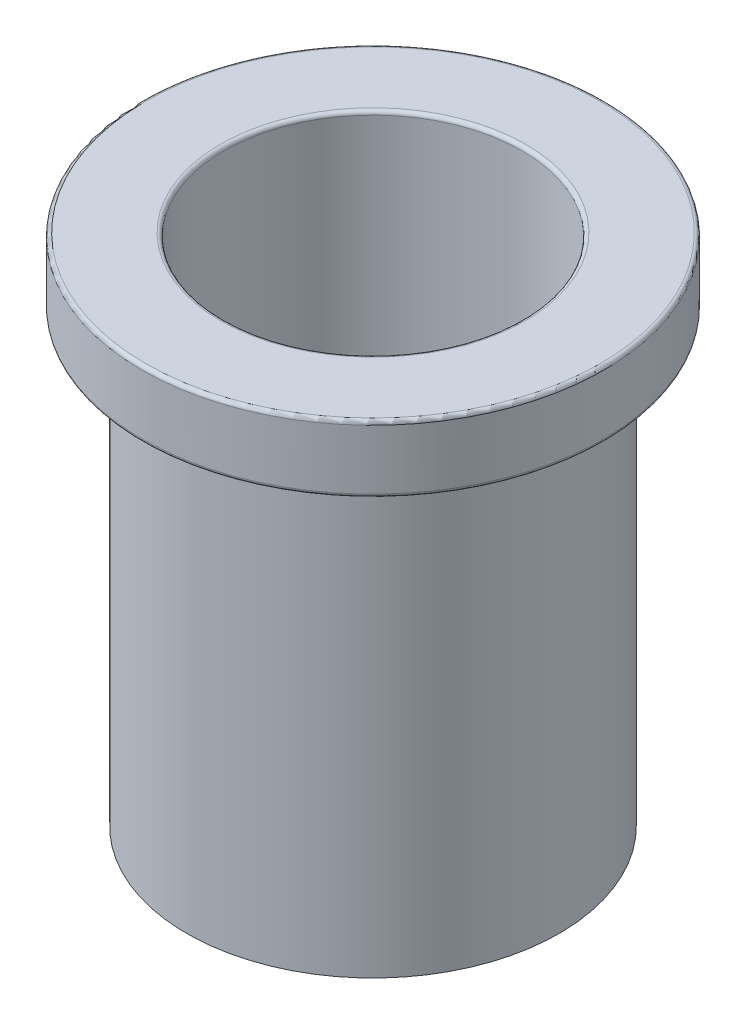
ISO-10303-21;
HEADER;
FILE_DESCRIPTION(('STEP AP214'),'2;1');
FILE_NAME('part.step','',(''),(''),'','','');
FILE_SCHEMA(('AUTOMOTIVE_DESIGN { 1 0 10303 214 1 1 1 1 }'));
ENDSEC;
DATA;
#1=APPLICATION_CONTEXT('core data for automotive mechanical design processes');
#2=APPLICATION_PROTOCOL_DEFINITION('international standard','automotive_design',2000,#1);
#3=PRODUCT_CONTEXT('',#1,'mechanical');
#4=PRODUCT('Part','Part','',(#3));
#5=PRODUCT_RELATED_PRODUCT_CATEGORY('part','',(#4));
#6=PRODUCT_DEFINITION_FORMATION('','',#4);
#7=PRODUCT_DEFINITION_CONTEXT('part definition',#1,'design');
#8=PRODUCT_DEFINITION('design','',#6,#7);
#9=PRODUCT_DEFINITION_SHAPE('','',#8);
#10=(LENGTH_UNIT() NAMED_UNIT(*) SI_UNIT(.MILLI.,.METRE.));
#11=(NAMED_UNIT(*) PLANE_ANGLE_UNIT() SI_UNIT($,.RADIAN.));
#12=(NAMED_UNIT(*) SI_UNIT($,.STERADIAN.) SOLID_ANGLE_UNIT());
#13=UNCERTAINTY_MEASURE_WITH_UNIT(LENGTH_MEASURE(1.E-05),#10,'distance_accuracy_value','');
#14=(GEOMETRIC_REPRESENTATION_CONTEXT(3) GLOBAL_UNCERTAINTY_ASSIGNED_CONTEXT((#13)) GLOBAL_UNIT_ASSIGNED_CONTEXT((#10,
#11,#12)) REPRESENTATION_CONTEXT('',''));
#15=CARTESIAN_POINT('',(0.,0.,0.));
#16=DIRECTION('',(0.,0.,1.));
#17=DIRECTION('',(1.,0.,0.));
#18=AXIS2_PLACEMENT_3D('',#15,#16,#17);
#19=CARTESIAN_POINT('',(3.175,0.,0.));
#20=DIRECTION('',(0.,-1.,0.));
#21=DIRECTION('',(0.,0.,-1.));
#22=AXIS2_PLACEMENT_3D('',#19,#20,#21);
#23=PLANE('',#22);
#24=CARTESIAN_POINT('',(0.,0.,0.));
#25=DIRECTION('',(0.,-1.,0.));
#26=DIRECTION('',(0.,0.,-1.));
#27=AXIS2_PLACEMENT_3D('',#24,#25,#26);
#28=CIRCLE('',#27,3.175);
#29=CARTESIAN_POINT('',(0.,0.,-3.175));
#30=VERTEX_POINT('',#29);
#31=EDGE_CURVE('E49',#30,#30,#28,.T.);
#32=ORIENTED_EDGE('',*,*,#31,.T.);
#33=EDGE_LOOP('',(#32));
#34=FACE_BOUND('',#33,.T.);
#35=CARTESIAN_POINT('',(0.,0.,0.));
#36=DIRECTION('',(0.,-1.,0.));
#37=DIRECTION('',(0.,0.,-1.));
#38=AXIS2_PLACEMENT_3D('',#35,#36,#37);
#39=CIRCLE('',#38,2.54);
#40=CARTESIAN_POINT('',(0.,0.,-2.54));
#41=VERTEX_POINT('',#40);
#42=EDGE_CURVE('E55',#41,#41,#39,.T.);
#43=ORIENTED_EDGE('',*,*,#42,.F.);
#44=EDGE_LOOP('',(#43));
#45=FACE_BOUND('',#44,.T.);
#46=ADVANCED_FACE('F24',(#34,#45),#23,.T.);
#47=CARTESIAN_POINT('',(0.,0.,0.));
#48=DIRECTION('',(0.,-1.,0.));
#49=DIRECTION('',(0.,0.,-1.));
#50=AXIS2_PLACEMENT_3D('',#47,#48,#49);
#51=CYLINDRICAL_SURFACE('',#50,3.175);
#52=CARTESIAN_POINT('',(0.,7.62,0.));
#53=DIRECTION('',(0.,-1.,0.));
#54=DIRECTION('',(0.,0.,-1.));
#55=AXIS2_PLACEMENT_3D('',#52,#53,#54);
#56=CIRCLE('',#55,3.175);
#57=CARTESIAN_POINT('',(0.,7.62,-3.175));
#58=VERTEX_POINT('',#57);
#59=EDGE_CURVE('E52',#58,#58,#56,.T.);
#60=ORIENTED_EDGE('',*,*,#59,.T.);
#61=EDGE_LOOP('',(#60));
#62=FACE_BOUND('',#61,.T.);
#63=ORIENTED_EDGE('',*,*,#31,.F.);
#64=EDGE_LOOP('',(#63));
#65=FACE_BOUND('',#64,.T.);
#66=ADVANCED_FACE('F62',(#62,#65),#51,.T.);
#67=CARTESIAN_POINT('',(3.937,7.62,0.));
#68=DIRECTION('',(0.,-1.,0.));
#69=DIRECTION('',(0.,0.,-1.));
#70=AXIS2_PLACEMENT_3D('',#67,#68,#69);
#71=PLANE('',#70);
#72=CARTESIAN_POINT('',(0.,7.62,0.));
#73=DIRECTION('',(0.,-1.,0.));
#74=DIRECTION('',(0.,0.,-1.));
#75=AXIS2_PLACEMENT_3D('',#72,#73,#74);
#76=CIRCLE('',#75,3.8735);
#77=CARTESIAN_POINT('',(0.,7.62,-3.8735));
#78=VERTEX_POINT('',#77);
#79=EDGE_CURVE('E34',#78,#78,#76,.T.);
#80=ORIENTED_EDGE('',*,*,#79,.T.);
#81=EDGE_LOOP('',(#80));
#82=FACE_BOUND('',#81,.T.);
#83=ORIENTED_EDGE('',*,*,#59,.F.);
#84=EDGE_LOOP('',(#83));
#85=FACE_BOUND('',#84,.T.);
#86=ADVANCED_FACE('F67',(#82,#85),#71,.T.);
#87=CARTESIAN_POINT('',(0.,0.,0.));
#88=DIRECTION('',(0.,-1.,0.));
#89=DIRECTION('',(0.,0.,-1.));
#90=AXIS2_PLACEMENT_3D('',#87,#88,#89);
#91=CYLINDRICAL_SURFACE('',#90,3.937);
#92=CARTESIAN_POINT('',(0.,7.6835,0.));
#93=DIRECTION('',(0.,-1.,0.));
#94=DIRECTION('',(0.,0.,-1.));
#95=AXIS2_PLACEMENT_3D('',#92,#93,#94);
#96=CIRCLE('',#95,3.937);
#97=CARTESIAN_POINT('',(0.,7.6835,-3.937));
#98=VERTEX_POINT('',#97);
#99=EDGE_CURVE('E10',#98,#98,#96,.F.);
#100=ORIENTED_EDGE('',*,*,#99,.T.);
#101=EDGE_LOOP('',(#100));
#102=FACE_BOUND('',#101,.T.);
#103=CARTESIAN_POINT('',(0.,8.6995,0.));
#104=DIRECTION('',(0.,1.,0.));
#105=DIRECTION('',(0.,0.,1.));
#106=AXIS2_PLACEMENT_3D('',#103,#104,#105);
#107=CIRCLE('',#106,3.937);
#108=CARTESIAN_POINT('',(0.,8.6995,3.937));
#109=VERTEX_POINT('',#108);
#110=EDGE_CURVE('E30',#109,#109,#107,.F.);
#111=ORIENTED_EDGE('',*,*,#110,.T.);
#112=EDGE_LOOP('',(#111));
#113=FACE_BOUND('',#112,.T.);
#114=ADVANCED_FACE('F74',(#102,#113),#91,.T.);
#115=CARTESIAN_POINT('',(2.54,8.763,0.));
#116=DIRECTION('',(0.,1.,0.));
#117=DIRECTION('',(0.,0.,1.));
#118=AXIS2_PLACEMENT_3D('',#115,#116,#117);
#119=PLANE('',#118);
#120=CARTESIAN_POINT('',(0.,8.763,0.));
#121=DIRECTION('',(0.,1.,0.));
#122=DIRECTION('',(0.,0.,1.));
#123=AXIS2_PLACEMENT_3D('',#120,#121,#122);
#124=CIRCLE('',#123,2.6035);
#125=CARTESIAN_POINT('',(0.,8.763,2.6035));
#126=VERTEX_POINT('',#125);
#127=EDGE_CURVE('E43',#126,#126,#124,.F.);
#128=ORIENTED_EDGE('',*,*,#127,.T.);
#129=EDGE_LOOP('',(#128));
#130=FACE_BOUND('',#129,.T.);
#131=CARTESIAN_POINT('',(0.,8.763,0.));
#132=DIRECTION('',(0.,1.,0.));
#133=DIRECTION('',(0.,0.,1.));
#134=AXIS2_PLACEMENT_3D('',#131,#132,#133);
#135=CIRCLE('',#134,3.8735);
#136=CARTESIAN_POINT('',(0.,8.763,3.8735));
#137=VERTEX_POINT('',#136);
#138=EDGE_CURVE('E46',#137,#137,#135,.T.);
#139=ORIENTED_EDGE('',*,*,#138,.T.);
#140=EDGE_LOOP('',(#139));
#141=FACE_BOUND('',#140,.T.);
#142=ADVANCED_FACE('F80',(#130,#141),#119,.T.);
#143=CARTESIAN_POINT('',(0.,0.,0.));
#144=DIRECTION('',(0.,-1.,0.));
#145=DIRECTION('',(0.,0.,-1.));
#146=AXIS2_PLACEMENT_3D('',#143,#144,#145);
#147=CYLINDRICAL_SURFACE('',#146,2.54);
#148=CARTESIAN_POINT('',(0.,8.6995,0.));
#149=DIRECTION('',(0.,1.,0.));
#150=DIRECTION('',(0.,0.,1.));
#151=AXIS2_PLACEMENT_3D('',#148,#149,#150);
#152=CIRCLE('',#151,2.54);
#153=CARTESIAN_POINT('',(0.,8.6995,2.54));
#154=VERTEX_POINT('',#153);
#155=EDGE_CURVE('E38',#154,#154,#152,.T.);
#156=ORIENTED_EDGE('',*,*,#155,.T.);
#157=EDGE_LOOP('',(#156));
#158=FACE_BOUND('',#157,.T.);
#159=ORIENTED_EDGE('',*,*,#42,.T.);
#160=EDGE_LOOP('',(#159));
#161=FACE_BOUND('',#160,.T.);
#162=ADVANCED_FACE('F59',(#158,#161),#147,.F.);
#163=CARTESIAN_POINT('',(0.,8.6995,0.));
#164=DIRECTION('',(0.,1.,0.));
#165=DIRECTION('',(0.,0.,1.));
#166=AXIS2_PLACEMENT_3D('',#163,#164,#165);
#167=TOROIDAL_SURFACE('',#166,2.6035,0.0635);
#168=ORIENTED_EDGE('',*,*,#155,.F.);
#169=EDGE_LOOP('',(#168));
#170=FACE_BOUND('',#169,.T.);
#171=ORIENTED_EDGE('',*,*,#127,.F.);
#172=EDGE_LOOP('',(#171));
#173=FACE_BOUND('',#172,.T.);
#174=ADVANCED_FACE('F86',(#170,#173),#167,.T.);
#175=CARTESIAN_POINT('',(0.,7.6835,0.));
#176=DIRECTION('',(0.,-1.,0.));
#177=DIRECTION('',(0.,0.,-1.));
#178=AXIS2_PLACEMENT_3D('',#175,#176,#177);
#179=TOROIDAL_SURFACE('',#178,3.8735,0.0635);
#180=ORIENTED_EDGE('',*,*,#99,.F.);
#181=EDGE_LOOP('',(#180));
#182=FACE_BOUND('',#181,.T.);
#183=ORIENTED_EDGE('',*,*,#79,.F.);
#184=EDGE_LOOP('',(#183));
#185=FACE_BOUND('',#184,.T.);
#186=ADVANCED_FACE('F90',(#182,#185),#179,.T.);
#187=CARTESIAN_POINT('',(0.,8.6995,0.));
#188=DIRECTION('',(0.,1.,0.));
#189=DIRECTION('',(0.,0.,1.));
#190=AXIS2_PLACEMENT_3D('',#187,#188,#189);
#191=TOROIDAL_SURFACE('',#190,3.8735,0.0635);
#192=ORIENTED_EDGE('',*,*,#138,.F.);
#193=EDGE_LOOP('',(#192));
#194=FACE_BOUND('',#193,.T.);
#195=ORIENTED_EDGE('',*,*,#110,.F.);
#196=EDGE_LOOP('',(#195));
#197=FACE_BOUND('',#196,.T.);
#198=ADVANCED_FACE('F94',(#194,#197),#191,.T.);
#199=CLOSED_SHELL('',(#46,#66,#86,#114,#142,#162,#174,#186,#198));
#200=MANIFOLD_SOLID_BREP('B2',#199);
#201=ADVANCED_BREP_SHAPE_REPRESENTATION('',(#18,#200),#14);
#202=SHAPE_DEFINITION_REPRESENTATION(#9,#201);
ENDSEC;
END-ISO-10303-21;
